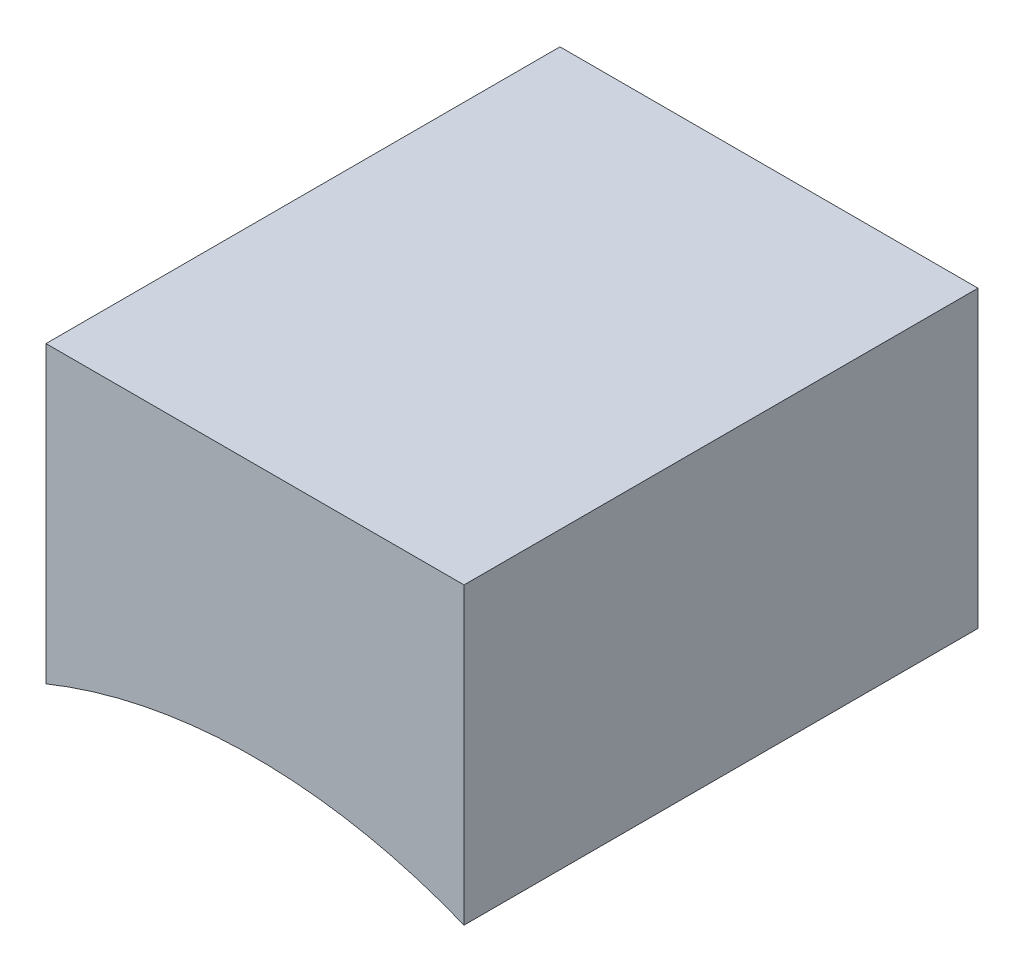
from build123d import *

# Parameters (mm, degrees)
EXTRUDE1_DEPTH = 19.05


with BuildPart() as part:
    # Sketch1 → Extrude1 (new body)
    with BuildSketch(Plane.XY):
        with BuildLine():
            Line((7.747, 19.141963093), (7.747, 30.063963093))
            Line((7.747, 30.063963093), (-7.747, 30.063963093))
            Line((-7.747, 30.063963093), (-7.747, 19.141963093))
            ThreePointArc((-7.747, 19.141963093), (0, 20.6502), (7.747, 19.141963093))
        make_face()
    extrude(amount=EXTRUDE1_DEPTH)


solid = part.part
